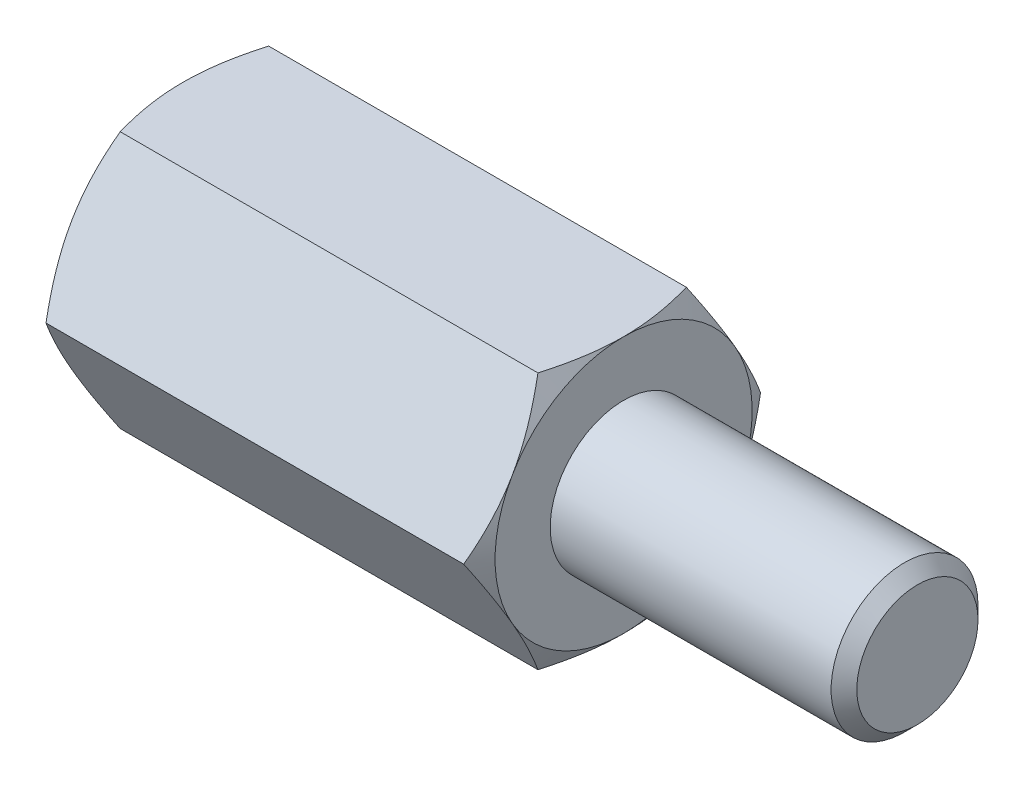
from build123d import *

# Parameters (mm, degrees)
EXTRUDE2_DEPTH = 6
SKETCH3_R      = 1.65
EXTRUDE3_DEPTH = 8
SKETCH5_R      = 2
EXTRUDE4_DEPTH = 8
CHAMFER1_SIZE  = 0.35


with BuildPart() as part:
    # Sketch1 → Extrude2 (new, symmetric)
    with BuildSketch(Plane(origin=(0, 0, 0), x_dir=(0, 0, -1), z_dir=(1, 0, 0))):
        Polygon((2.020725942, 3.5), (-2.020725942, 3.5), (-4.041451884, 0), (-2.020725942, -3.5), (2.020725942, -3.5), (4.041451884, 0), align=None)
    extrude(amount=EXTRUDE2_DEPTH, both=True)

    # Sketch2 → Cut-Revolve1 (revolve, cut)
    with BuildSketch(Plane.XY):
        with BuildLine():
            Line((-6, 3.5), (-4.5, 6.098076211))
            ThreePointArc((-4.5, 6.098076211), (-4.98810136, 7.276457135), (-6, 6.5))
            Line((-6, 6.5), (-6, 3.5))
        make_face()
    cut_revolve1 = revolve(axis=Axis((0, 0, 0), (1, 0, 0)), mode=Mode.SUBTRACT)

    # Mirror1: Cut-Revolve1 across plane
    add(cut_revolve1.mirror(Plane(origin=(0, 0, 0), x_dir=(0, 0, 1), z_dir=(1, 0, 0))), mode=Mode.SUBTRACT)

    # Sketch3 → Extrude3 (cut)
    with BuildSketch(Plane.ZY.offset(6)):
        Circle(SKETCH3_R)
    extrude(amount=-EXTRUDE3_DEPTH, mode=Mode.SUBTRACT)

    # Sketch4 → Cut-Revolve2 (revolve, cut)
    with BuildSketch(Plane.XY, mode=Mode.PRIVATE) as cut_revolve2_sk:
        Polygon((2, 0), (2, 1.65), (2.952627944, 0), align=None)
    revolve(cut_revolve2_sk.sketch.rotate(Axis((2.952627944, 0, 0), (-1, 0, 0)), 270), axis=Axis((2.952627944, 0, 0), (-1, 0, 0)), mode=Mode.SUBTRACT)

    # Sketch5 → Extrude4 (add)
    with BuildSketch(Plane(origin=(6, 0, 0), x_dir=(0, 0, -1), z_dir=(1, 0, 0))):
        Circle(SKETCH5_R)
    extrude(amount=EXTRUDE4_DEPTH)

    # Chamfer1
    chamfer1_edges = [part.edges().sort_by_distance(p)[0] for p in [
        (14, 0, 2),
    ]]
    chamfer(chamfer1_edges, length=CHAMFER1_SIZE)


solid = part.part
